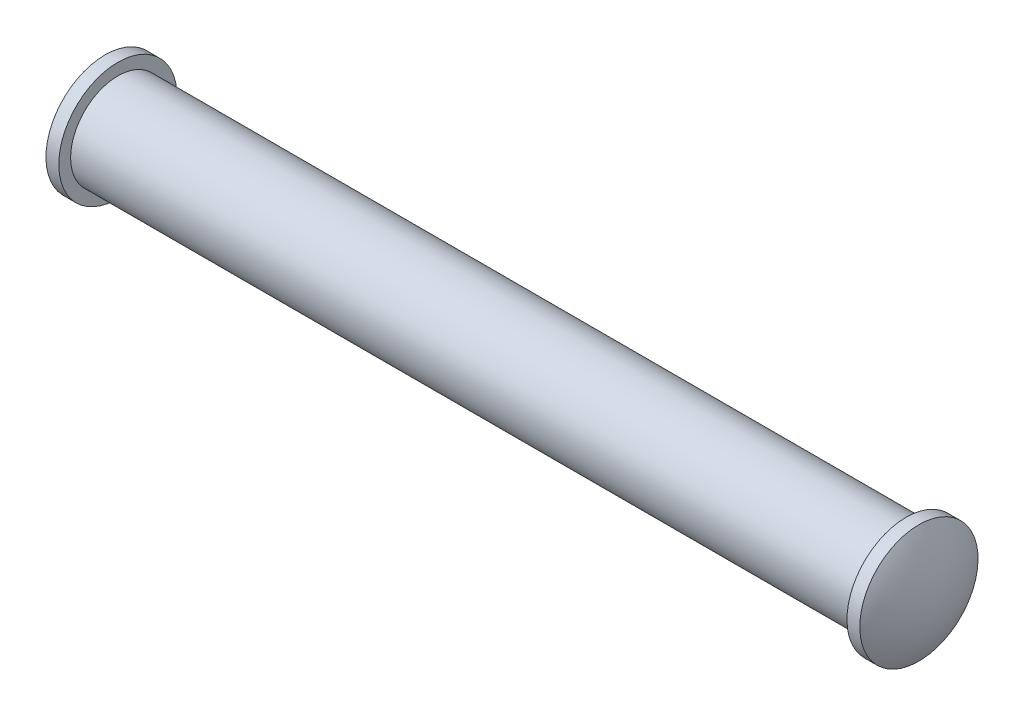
ISO-10303-21;
HEADER;
FILE_DESCRIPTION(('STEP AP214'),'2;1');
FILE_NAME('part.step','',(''),(''),'','','');
FILE_SCHEMA(('AUTOMOTIVE_DESIGN { 1 0 10303 214 1 1 1 1 }'));
ENDSEC;
DATA;
#1=APPLICATION_CONTEXT('core data for automotive mechanical design processes');
#2=APPLICATION_PROTOCOL_DEFINITION('international standard','automotive_design',2000,#1);
#3=PRODUCT_CONTEXT('',#1,'mechanical');
#4=PRODUCT('Part','Part','',(#3));
#5=PRODUCT_RELATED_PRODUCT_CATEGORY('part','',(#4));
#6=PRODUCT_DEFINITION_FORMATION('','',#4);
#7=PRODUCT_DEFINITION_CONTEXT('part definition',#1,'design');
#8=PRODUCT_DEFINITION('design','',#6,#7);
#9=PRODUCT_DEFINITION_SHAPE('','',#8);
#10=(LENGTH_UNIT() NAMED_UNIT(*) SI_UNIT(.MILLI.,.METRE.));
#11=(NAMED_UNIT(*) PLANE_ANGLE_UNIT() SI_UNIT($,.RADIAN.));
#12=(NAMED_UNIT(*) SI_UNIT($,.STERADIAN.) SOLID_ANGLE_UNIT());
#13=UNCERTAINTY_MEASURE_WITH_UNIT(LENGTH_MEASURE(1.E-05),#10,'distance_accuracy_value','');
#14=(GEOMETRIC_REPRESENTATION_CONTEXT(3) GLOBAL_UNCERTAINTY_ASSIGNED_CONTEXT((#13)) GLOBAL_UNIT_ASSIGNED_CONTEXT((#10,
#11,#12)) REPRESENTATION_CONTEXT('',''));
#15=CARTESIAN_POINT('',(0.,0.,0.));
#16=DIRECTION('',(0.,0.,1.));
#17=DIRECTION('',(1.,0.,0.));
#18=AXIS2_PLACEMENT_3D('',#15,#16,#17);
#19=CARTESIAN_POINT('',(76.2,0.,0.));
#20=DIRECTION('',(-1.,0.,0.));
#21=DIRECTION('',(0.,0.,1.));
#22=AXIS2_PLACEMENT_3D('',#19,#20,#21);
#23=CYLINDRICAL_SURFACE('',#22,4.572);
#24=CARTESIAN_POINT('',(76.2,0.,0.));
#25=DIRECTION('',(1.,0.,0.));
#26=DIRECTION('',(0.,0.,-1.));
#27=AXIS2_PLACEMENT_3D('',#24,#25,#26);
#28=CIRCLE('',#27,4.572);
#29=CARTESIAN_POINT('',(76.2,0.,4.572));
#30=VERTEX_POINT('',#29);
#31=EDGE_CURVE('E10',#30,#30,#28,.T.);
#32=CARTESIAN_POINT('',(0.,0.,0.));
#33=DIRECTION('',(-1.,0.,0.));
#34=DIRECTION('',(0.,-1.,0.));
#35=AXIS2_PLACEMENT_3D('',#32,#33,#34);
#36=CIRCLE('',#35,4.572);
#37=CARTESIAN_POINT('',(0.,0.,4.572));
#38=VERTEX_POINT('',#37);
#39=EDGE_CURVE('E42',#38,#38,#36,.T.);
#40=CARTESIAN_POINT('',(76.2,0.,4.572));
#41=CARTESIAN_POINT('',(75.40625,0.,4.572));
#42=CARTESIAN_POINT('',(74.6125,0.,4.572));
#43=CARTESIAN_POINT('',(73.025,0.,4.572));
#44=CARTESIAN_POINT('',(72.23125,0.,4.572));
#45=CARTESIAN_POINT('',(70.64375,0.,4.572));
#46=CARTESIAN_POINT('',(69.85,0.,4.572));
#47=CARTESIAN_POINT('',(68.2625,0.,4.572));
#48=CARTESIAN_POINT('',(67.46875,0.,4.572));
#49=CARTESIAN_POINT('',(65.88125,0.,4.572));
#50=CARTESIAN_POINT('',(65.0875,0.,4.572));
#51=CARTESIAN_POINT('',(63.5,0.,4.572));
#52=CARTESIAN_POINT('',(62.70625,0.,4.572));
#53=CARTESIAN_POINT('',(61.11875,0.,4.572));
#54=CARTESIAN_POINT('',(60.325,0.,4.572));
#55=CARTESIAN_POINT('',(58.7375,0.,4.572));
#56=CARTESIAN_POINT('',(57.94375,0.,4.572));
#57=CARTESIAN_POINT('',(56.35625,0.,4.572));
#58=CARTESIAN_POINT('',(55.5625,0.,4.572));
#59=CARTESIAN_POINT('',(53.975,0.,4.572));
#60=CARTESIAN_POINT('',(53.18125,0.,4.572));
#61=CARTESIAN_POINT('',(51.59375,0.,4.572));
#62=CARTESIAN_POINT('',(50.8,0.,4.572));
#63=CARTESIAN_POINT('',(49.2125,0.,4.572));
#64=CARTESIAN_POINT('',(48.41875,0.,4.572));
#65=CARTESIAN_POINT('',(46.83125,0.,4.572));
#66=CARTESIAN_POINT('',(46.0375,0.,4.572));
#67=CARTESIAN_POINT('',(44.45,0.,4.572));
#68=CARTESIAN_POINT('',(43.65625,0.,4.572));
#69=CARTESIAN_POINT('',(42.06875,0.,4.572));
#70=CARTESIAN_POINT('',(41.275,0.,4.572));
#71=CARTESIAN_POINT('',(39.6875,0.,4.572));
#72=CARTESIAN_POINT('',(38.89375,0.,4.572));
#73=CARTESIAN_POINT('',(37.30625,0.,4.572));
#74=CARTESIAN_POINT('',(36.5125,0.,4.572));
#75=CARTESIAN_POINT('',(34.925,0.,4.572));
#76=CARTESIAN_POINT('',(34.13125,0.,4.572));
#77=CARTESIAN_POINT('',(32.54375,0.,4.572));
#78=CARTESIAN_POINT('',(31.75,0.,4.572));
#79=CARTESIAN_POINT('',(30.1625,0.,4.572));
#80=CARTESIAN_POINT('',(29.36875,0.,4.572));
#81=CARTESIAN_POINT('',(27.78125,0.,4.572));
#82=CARTESIAN_POINT('',(26.9875,0.,4.572));
#83=CARTESIAN_POINT('',(25.4,0.,4.572));
#84=CARTESIAN_POINT('',(24.60625,0.,4.572));
#85=CARTESIAN_POINT('',(23.01875,0.,4.572));
#86=CARTESIAN_POINT('',(22.225,0.,4.572));
#87=CARTESIAN_POINT('',(20.6375,0.,4.572));
#88=CARTESIAN_POINT('',(19.84375,0.,4.572));
#89=CARTESIAN_POINT('',(18.25625,0.,4.572));
#90=CARTESIAN_POINT('',(17.4625,0.,4.572));
#91=CARTESIAN_POINT('',(15.875,0.,4.572));
#92=CARTESIAN_POINT('',(15.08125,0.,4.572));
#93=CARTESIAN_POINT('',(13.49375,0.,4.572));
#94=CARTESIAN_POINT('',(12.7,0.,4.572));
#95=CARTESIAN_POINT('',(11.1125,0.,4.572));
#96=CARTESIAN_POINT('',(10.31875,0.,4.572));
#97=CARTESIAN_POINT('',(8.73125,0.,4.572));
#98=CARTESIAN_POINT('',(7.93750000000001,0.,4.572));
#99=CARTESIAN_POINT('',(6.35,0.,4.572));
#100=CARTESIAN_POINT('',(5.55625,0.,4.572));
#101=CARTESIAN_POINT('',(3.96875,0.,4.572));
#102=CARTESIAN_POINT('',(3.175,0.,4.572));
#103=CARTESIAN_POINT('',(1.5875,0.,4.572));
#104=CARTESIAN_POINT('',(0.793750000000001,0.,4.572));
#105=CARTESIAN_POINT('',(0.,0.,4.572));
#106=B_SPLINE_CURVE_WITH_KNOTS('',3,(#40,#41,#42,#43,#44,#45,#46,#47,#48,#49,#50,#51,#52,#53,
#54,#55,#56,#57,#58,#59,#60,#61,#62,#63,#64,#65,#66,#67,#68,#69,#70,#71,#72,#73,#74,#75,#76,#77,
#78,#79,#80,#81,#82,#83,#84,#85,#86,#87,#88,#89,#90,#91,#92,#93,#94,#95,#96,#97,#98,#99,#100,
#101,#102,#103,#104,#105),.UNSPECIFIED.,.F.,.F.,(4,2,2,2,2,2,2,2,2,2,2,2,2,2,2,2,2,2,2,2,2,2,2,
2,2,2,2,2,2,2,2,2,4),(0.,2.38125,4.7625,7.14375,9.52500000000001,11.90625,14.2875,16.66875,
19.05,21.43125,23.8125,26.19375,28.575,30.95625,33.3375,35.71875,38.1,40.48125,42.8625,45.24375,
47.625,50.00625,52.3875,54.76875,57.15,59.53125,61.9125,64.29375,66.675,69.05625,71.4375,
73.81875,76.2),.UNSPECIFIED.);
#107=EDGE_CURVE('BSEAM36',#30,#38,#106,.T.);
#108=ORIENTED_EDGE('',*,*,#31,.F.);
#109=ORIENTED_EDGE('',*,*,#39,.F.);
#110=ORIENTED_EDGE('',*,*,#107,.T.);
#111=ORIENTED_EDGE('',*,*,#107,.F.);
#112=EDGE_LOOP('',(#108,#110,#109,#111));
#113=FACE_BOUND('',#112,.T.);
#114=ADVANCED_FACE('F36',(#113),#23,.T.);
#115=CARTESIAN_POINT('',(0.,-5.715,0.));
#116=DIRECTION('',(-1.,0.,0.));
#117=DIRECTION('',(0.,-1.,0.));
#118=AXIS2_PLACEMENT_3D('',#115,#116,#117);
#119=PLANE('',#118);
#120=ORIENTED_EDGE('',*,*,#39,.T.);
#121=EDGE_LOOP('',(#120));
#122=FACE_BOUND('',#121,.T.);
#123=CARTESIAN_POINT('',(0.,0.,0.));
#124=DIRECTION('',(1.,0.,0.));
#125=DIRECTION('',(0.,1.,0.));
#126=AXIS2_PLACEMENT_3D('',#123,#124,#125);
#127=CIRCLE('',#126,5.715);
#128=CARTESIAN_POINT('',(0.,5.715,0.));
#129=VERTEX_POINT('',#128);
#130=EDGE_CURVE('E50',#129,#129,#127,.T.);
#131=ORIENTED_EDGE('',*,*,#130,.T.);
#132=EDGE_LOOP('',(#131));
#133=FACE_BOUND('',#132,.T.);
#134=ADVANCED_FACE('F80',(#122,#133),#119,.F.);
#135=CARTESIAN_POINT('',(8.36449882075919,0.,0.));
#136=DIRECTION('',(1.,0.,0.));
#137=DIRECTION('',(0.,1.,0.));
#138=AXIS2_PLACEMENT_3D('',#135,#136,#137);
#139=SPHERICAL_SURFACE('',#138,11.176);
#140=CARTESIAN_POINT('',(-1.23975810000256,0.,0.));
#141=DIRECTION('',(1.,0.,0.));
#142=DIRECTION('',(0.,1.,0.));
#143=AXIS2_PLACEMENT_3D('',#140,#141,#142);
#144=CIRCLE('',#143,5.715);
#145=CARTESIAN_POINT('',(-1.23975810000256,5.715,0.));
#146=VERTEX_POINT('',#145);
#147=EDGE_CURVE('E46',#146,#146,#144,.T.);
#148=ORIENTED_EDGE('',*,*,#147,.F.);
#149=EDGE_LOOP('',(#148));
#150=FACE_BOUND('',#149,.T.);
#151=ADVANCED_FACE('F76',(#150),#139,.T.);
#152=CARTESIAN_POINT('',(0.,0.,0.));
#153=DIRECTION('',(1.,0.,0.));
#154=DIRECTION('',(0.,1.,0.));
#155=AXIS2_PLACEMENT_3D('',#152,#153,#154);
#156=CYLINDRICAL_SURFACE('',#155,5.715);
#157=ORIENTED_EDGE('',*,*,#130,.F.);
#158=EDGE_LOOP('',(#157));
#159=FACE_BOUND('',#158,.T.);
#160=ORIENTED_EDGE('',*,*,#147,.T.);
#161=EDGE_LOOP('',(#160));
#162=FACE_BOUND('',#161,.T.);
#163=ADVANCED_FACE('F68',(#159,#162),#156,.T.);
#164=CARTESIAN_POINT('',(76.2,-5.715,0.));
#165=DIRECTION('',(1.,0.,0.));
#166=DIRECTION('',(0.,-1.,0.));
#167=AXIS2_PLACEMENT_3D('',#164,#165,#166);
#168=PLANE('',#167);
#169=ORIENTED_EDGE('',*,*,#31,.T.);
#170=EDGE_LOOP('',(#169));
#171=FACE_BOUND('',#170,.T.);
#172=CARTESIAN_POINT('',(76.2,0.,0.));
#173=DIRECTION('',(1.,0.,0.));
#174=DIRECTION('',(0.,1.,0.));
#175=AXIS2_PLACEMENT_3D('',#172,#173,#174);
#176=CIRCLE('',#175,5.715);
#177=CARTESIAN_POINT('',(76.2,5.715,0.));
#178=VERTEX_POINT('',#177);
#179=EDGE_CURVE('E58',#178,#178,#176,.T.);
#180=ORIENTED_EDGE('',*,*,#179,.F.);
#181=EDGE_LOOP('',(#180));
#182=FACE_BOUND('',#181,.T.);
#183=ADVANCED_FACE('F65',(#171,#182),#168,.F.);
#184=CARTESIAN_POINT('',(67.8355011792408,0.,0.));
#185=DIRECTION('',(-1.,0.,0.));
#186=DIRECTION('',(0.,1.,0.));
#187=AXIS2_PLACEMENT_3D('',#184,#185,#186);
#188=SPHERICAL_SURFACE('',#187,11.176);
#189=CARTESIAN_POINT('',(77.4397581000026,0.,0.));
#190=DIRECTION('',(1.,0.,0.));
#191=DIRECTION('',(0.,1.,0.));
#192=AXIS2_PLACEMENT_3D('',#189,#190,#191);
#193=CIRCLE('',#192,5.715);
#194=CARTESIAN_POINT('',(77.4397581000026,5.715,0.));
#195=VERTEX_POINT('',#194);
#196=EDGE_CURVE('E55',#195,#195,#193,.T.);
#197=ORIENTED_EDGE('',*,*,#196,.T.);
#198=EDGE_LOOP('',(#197));
#199=FACE_BOUND('',#198,.T.);
#200=ADVANCED_FACE('F67',(#199),#188,.T.);
#201=CARTESIAN_POINT('',(76.2,0.,0.));
#202=DIRECTION('',(-1.,0.,0.));
#203=DIRECTION('',(0.,1.,0.));
#204=AXIS2_PLACEMENT_3D('',#201,#202,#203);
#205=CYLINDRICAL_SURFACE('',#204,5.715);
#206=ORIENTED_EDGE('',*,*,#179,.T.);
#207=EDGE_LOOP('',(#206));
#208=FACE_BOUND('',#207,.T.);
#209=ORIENTED_EDGE('',*,*,#196,.F.);
#210=EDGE_LOOP('',(#209));
#211=FACE_BOUND('',#210,.T.);
#212=ADVANCED_FACE('F62',(#208,#211),#205,.T.);
#213=CLOSED_SHELL('',(#114,#134,#151,#163,#183,#200,#212));
#214=MANIFOLD_SOLID_BREP('B2',#213);
#215=ADVANCED_BREP_SHAPE_REPRESENTATION('',(#18,#214),#14);
#216=SHAPE_DEFINITION_REPRESENTATION(#9,#215);
ENDSEC;
END-ISO-10303-21;
